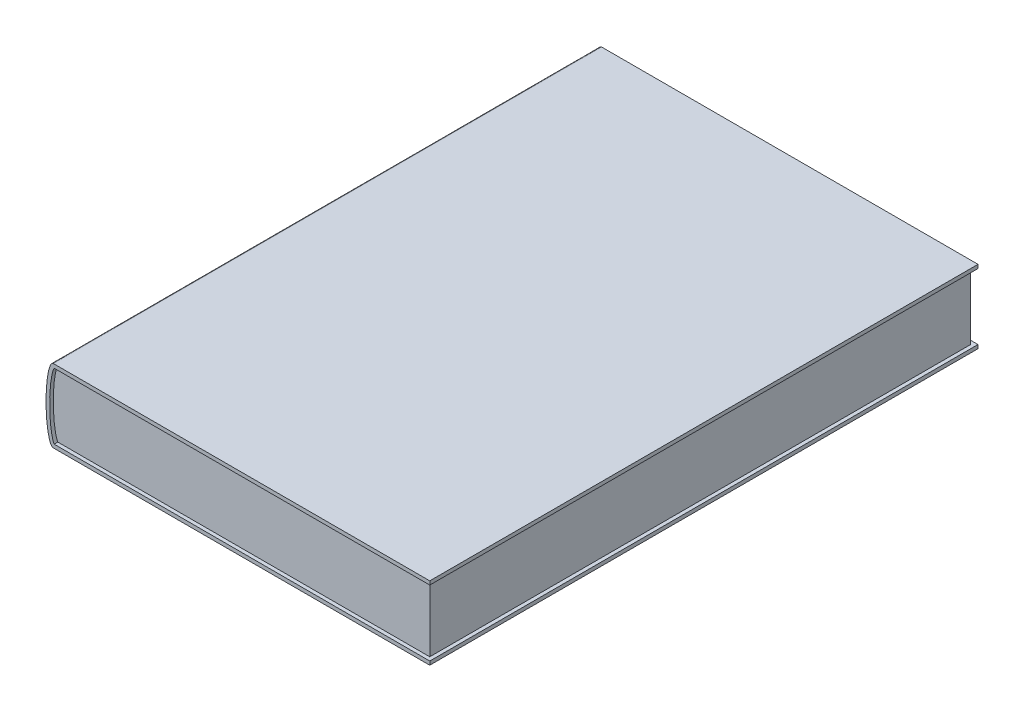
from build123d import *

# Parameters (mm, degrees)
BOSS_EXTRU_1_DEPTH = 150
BOSS_EXTRU_2_DEPTH = 148


with BuildPart() as part:
    # Esquisse1 → Boss.-Extru.1 (new, symmetric)
    with BuildSketch(Plane.XY):
        with BuildLine():
            Line((103, 20), (-103, 20))
            add(Edge.make_bspline(
                [(-103, 20), (-107, 20), (-107, 0), (-107, -20), (-103, -20)],
                knots=[0, 0, 0, 1.570796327, 1.570796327, 3.141592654, 3.141592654, 3.141592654], degree=2, weights=[1, 0.707106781, 1, 0.707106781, 1]))
            Line((-103, -20), (103, -20))
            Line((103, -20), (103, -18))
            Line((103, -18), (-102.515867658, -18))
            add(Edge.make_bspline(
                [(-102.515867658, 18), (-102.547905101, 17.949333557), (-102.603716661, 17.854862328), (-102.743990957, 17.588135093), (-102.932120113, 17.16430708), (-103.16975067, 16.511439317), (-103.485635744, 15.471565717), (-103.863661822, 13.879877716), (-104.260229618, 11.581523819), (-104.583265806, 8.967825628), (-104.900962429, 5.16281344), (-105.066025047, 0), (-104.900962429, -5.16281344), (-104.583265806, -8.967825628), (-104.260229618, -11.581523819), (-103.863661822, -13.879877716), (-103.485635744, -15.471565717), (-103.16975067, -16.511439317), (-102.932120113, -17.16430708), (-102.743990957, -17.588135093), (-102.603716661, -17.854862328), (-102.547905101, -17.949333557), (-102.515867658, -18)],
                knots=[0.30633865, 0.30633865, 0.30633865, 0.30633865, 0.345852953, 0.385367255, 0.46439586, 0.543424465, 0.62245307, 0.780510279, 0.938567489, 1.096624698, 1.254681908, 1.570796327, 1.886910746, 2.044967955, 2.203025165, 2.361082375, 2.519139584, 2.598168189, 2.677196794, 2.756225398, 2.795739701, 2.835254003, 2.835254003, 2.835254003, 2.835254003], degree=3))
            Line((-102.515867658, 18), (103, 18))
            Line((103, 18), (103, 20))
        make_face()
    extrude(amount=BOSS_EXTRU_1_DEPTH, both=True)

    # Esquisse2 → Boss.-Extru.2 (add, symmetric)
    with BuildSketch(Plane.XY):
        with BuildLine():
            Line((-102.515867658, -18), (101, -18))
            Line((101, -18), (101, 18))
            Line((101, 18), (-102.515867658, 18))
            add(Edge.make_bspline(
                [(-102.515867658, 18), (-102.547905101, 17.949333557), (-102.603716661, 17.854862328), (-102.743990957, 17.588135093), (-102.932120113, 17.16430708), (-103.16975067, 16.511439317), (-103.485635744, 15.471565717), (-103.863661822, 13.879877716), (-104.260229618, 11.581523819), (-104.583265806, 8.967825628), (-104.900962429, 5.16281344), (-105.066025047, 0), (-104.900962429, -5.16281344), (-104.583265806, -8.967825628), (-104.260229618, -11.581523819), (-103.863661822, -13.879877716), (-103.485635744, -15.471565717), (-103.16975067, -16.511439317), (-102.932120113, -17.16430708), (-102.743990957, -17.588135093), (-102.603716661, -17.854862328), (-102.547905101, -17.949333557), (-102.515867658, -18)],
                knots=[0.30633865, 0.30633865, 0.30633865, 0.30633865, 0.345852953, 0.385367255, 0.46439586, 0.543424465, 0.62245307, 0.780510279, 0.938567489, 1.096624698, 1.254681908, 1.570796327, 1.886910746, 2.044967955, 2.203025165, 2.361082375, 2.519139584, 2.598168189, 2.677196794, 2.756225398, 2.795739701, 2.835254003, 2.835254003, 2.835254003, 2.835254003], degree=3))
        make_face()
    extrude(amount=BOSS_EXTRU_2_DEPTH, both=True)


solid = part.part
